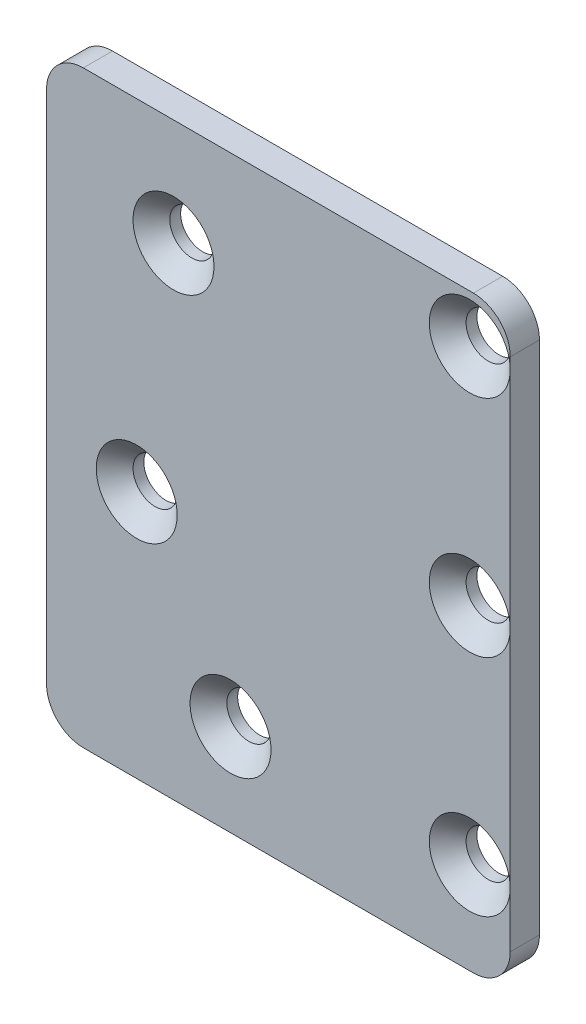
ISO-10303-21;
HEADER;
FILE_DESCRIPTION(('STEP AP214'),'2;1');
FILE_NAME('part.step','',(''),(''),'','','');
FILE_SCHEMA(('AUTOMOTIVE_DESIGN { 1 0 10303 214 1 1 1 1 }'));
ENDSEC;
DATA;
#1=APPLICATION_CONTEXT('core data for automotive mechanical design processes');
#2=APPLICATION_PROTOCOL_DEFINITION('international standard','automotive_design',2000,#1);
#3=PRODUCT_CONTEXT('',#1,'mechanical');
#4=PRODUCT('Part','Part','',(#3));
#5=PRODUCT_RELATED_PRODUCT_CATEGORY('part','',(#4));
#6=PRODUCT_DEFINITION_FORMATION('','',#4);
#7=PRODUCT_DEFINITION_CONTEXT('part definition',#1,'design');
#8=PRODUCT_DEFINITION('design','',#6,#7);
#9=PRODUCT_DEFINITION_SHAPE('','',#8);
#10=(LENGTH_UNIT() NAMED_UNIT(*) SI_UNIT(.MILLI.,.METRE.));
#11=(NAMED_UNIT(*) PLANE_ANGLE_UNIT() SI_UNIT($,.RADIAN.));
#12=(NAMED_UNIT(*) SI_UNIT($,.STERADIAN.) SOLID_ANGLE_UNIT());
#13=UNCERTAINTY_MEASURE_WITH_UNIT(LENGTH_MEASURE(1.E-05),#10,'distance_accuracy_value','');
#14=(GEOMETRIC_REPRESENTATION_CONTEXT(3) GLOBAL_UNCERTAINTY_ASSIGNED_CONTEXT((#13)) GLOBAL_UNIT_ASSIGNED_CONTEXT((#10,
#11,#12)) REPRESENTATION_CONTEXT('',''));
#15=CARTESIAN_POINT('',(0.,0.,0.));
#16=DIRECTION('',(0.,0.,1.));
#17=DIRECTION('',(1.,0.,0.));
#18=AXIS2_PLACEMENT_3D('',#15,#16,#17);
#19=CARTESIAN_POINT('',(0.,32.,0.));
#20=DIRECTION('',(0.,0.,-1.));
#21=DIRECTION('',(-1.,0.,0.));
#22=AXIS2_PLACEMENT_3D('',#19,#20,#21);
#23=PLANE('',#22);
#24=DIRECTION('',(-0.671519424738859,0.740986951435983,0.));
#25=VECTOR('',#24,1.);
#26=CARTESIAN_POINT('',(17.4070936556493,15.7751786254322,0.));
#27=LINE('',#26,#25);
#28=CARTESIAN_POINT('',(17.779506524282,15.3642402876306,0.));
#29=VERTEX_POINT('',#28);
#30=CARTESIAN_POINT('',(10.529506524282,23.3642402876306,0.));
#31=VERTEX_POINT('',#30);
#32=EDGE_CURVE('E459',#29,#31,#27,.T.);
#33=ORIENTED_EDGE('',*,*,#32,.F.);
#34=CARTESIAN_POINT('',(18.15,15.7,0.));
#35=DIRECTION('',(0.,0.,-1.));
#36=DIRECTION('',(-1.,0.,0.));
#37=AXIS2_PLACEMENT_3D('',#34,#35,#36);
#38=CIRCLE('',#37,0.499999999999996);
#39=CARTESIAN_POINT('',(18.520493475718,16.0357597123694,0.));
#40=VERTEX_POINT('',#39);
#41=EDGE_CURVE('E470',#40,#29,#38,.T.);
#42=ORIENTED_EDGE('',*,*,#41,.F.);
#43=DIRECTION('',(-0.671519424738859,0.740986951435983,0.));
#44=VECTOR('',#43,1.);
#45=CARTESIAN_POINT('',(18.1480806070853,16.446698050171,0.));
#46=LINE('',#45,#44);
#47=CARTESIAN_POINT('',(11.270493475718,24.0357597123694,0.));
#48=VERTEX_POINT('',#47);
#49=EDGE_CURVE('E483',#40,#48,#46,.T.);
#50=ORIENTED_EDGE('',*,*,#49,.T.);
#51=CARTESIAN_POINT('',(10.9,23.7,0.));
#52=DIRECTION('',(0.,0.,-1.));
#53=DIRECTION('',(-1.,0.,0.));
#54=AXIS2_PLACEMENT_3D('',#51,#52,#53);
#55=CIRCLE('',#54,0.499999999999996);
#56=EDGE_CURVE('E480',#31,#48,#55,.T.);
#57=ORIENTED_EDGE('',*,*,#56,.F.);
#58=EDGE_LOOP('',(#33,#42,#50,#57));
#59=FACE_BOUND('',#58,.T.);
#60=DIRECTION('',(-0.671519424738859,0.740986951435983,0.));
#61=VECTOR('',#60,1.);
#62=CARTESIAN_POINT('',(17.1847975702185,15.5737227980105,0.));
#63=LINE('',#62,#61);
#64=CARTESIAN_POINT('',(17.5572104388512,15.1627844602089,0.));
#65=VERTEX_POINT('',#64);
#66=CARTESIAN_POINT('',(10.3072104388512,23.1627844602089,0.));
#67=VERTEX_POINT('',#66);
#68=EDGE_CURVE('E398',#65,#67,#63,.T.);
#69=ORIENTED_EDGE('',*,*,#68,.T.);
#70=CARTESIAN_POINT('',(10.9,23.7,0.));
#71=DIRECTION('',(0.,0.,-1.));
#72=DIRECTION('',(-1.,0.,0.));
#73=AXIS2_PLACEMENT_3D('',#70,#71,#72);
#74=CIRCLE('',#73,0.799999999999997);
#75=CARTESIAN_POINT('',(11.4927895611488,24.2372155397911,0.));
#76=VERTEX_POINT('',#75);
#77=EDGE_CURVE('E361',#67,#76,#74,.T.);
#78=ORIENTED_EDGE('',*,*,#77,.T.);
#79=DIRECTION('',(-0.67151942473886,0.740986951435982,0.));
#80=VECTOR('',#79,1.);
#81=CARTESIAN_POINT('',(18.3703766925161,16.6481538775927,0.));
#82=LINE('',#81,#80);
#83=CARTESIAN_POINT('',(18.7427895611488,16.2372155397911,0.));
#84=VERTEX_POINT('',#83);
#85=EDGE_CURVE('E404',#84,#76,#82,.T.);
#86=ORIENTED_EDGE('',*,*,#85,.F.);
#87=CARTESIAN_POINT('',(18.15,15.7,0.));
#88=DIRECTION('',(0.,0.,-1.));
#89=DIRECTION('',(-1.,0.,0.));
#90=AXIS2_PLACEMENT_3D('',#87,#88,#89);
#91=CIRCLE('',#90,0.800000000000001);
#92=EDGE_CURVE('E401',#84,#65,#91,.T.);
#93=ORIENTED_EDGE('',*,*,#92,.T.);
#94=EDGE_LOOP('',(#69,#78,#86,#93));
#95=FACE_BOUND('',#94,.T.);
#96=ADVANCED_FACE('F81',(#59,#95),#23,.T.);
#97=CARTESIAN_POINT('',(17.4070936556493,15.7751786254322,0.5));
#98=DIRECTION('',(-0.740986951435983,-0.671519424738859,0.));
#99=DIRECTION('',(0.671519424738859,-0.740986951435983,0.));
#100=AXIS2_PLACEMENT_3D('',#97,#98,#99);
#101=PLANE('',#100);
#102=ORIENTED_EDGE('',*,*,#32,.T.);
#103=DIRECTION('',(0.,0.,-1.));
#104=VECTOR('',#103,1.);
#105=CARTESIAN_POINT('',(10.529506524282,23.3642402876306,0.5));
#106=LINE('',#105,#104);
#107=CARTESIAN_POINT('',(10.529506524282,23.3642402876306,0.5));
#108=VERTEX_POINT('',#107);
#109=EDGE_CURVE('E478',#108,#31,#106,.T.);
#110=ORIENTED_EDGE('',*,*,#109,.F.);
#111=DIRECTION('',(-0.671519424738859,0.740986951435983,0.));
#112=VECTOR('',#111,1.);
#113=CARTESIAN_POINT('',(17.4070936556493,15.7751786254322,0.5));
#114=LINE('',#113,#112);
#115=CARTESIAN_POINT('',(17.779506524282,15.3642402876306,0.5));
#116=VERTEX_POINT('',#115);
#117=EDGE_CURVE('E466',#116,#108,#114,.T.);
#118=ORIENTED_EDGE('',*,*,#117,.F.);
#119=DIRECTION('',(0.,0.,-1.));
#120=VECTOR('',#119,1.);
#121=CARTESIAN_POINT('',(17.779506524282,15.3642402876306,0.5));
#122=LINE('',#121,#120);
#123=EDGE_CURVE('E488',#116,#29,#122,.T.);
#124=ORIENTED_EDGE('',*,*,#123,.T.);
#125=EDGE_LOOP('',(#102,#110,#118,#124));
#126=FACE_BOUND('',#125,.T.);
#127=ADVANCED_FACE('F661',(#126),#101,.F.);
#128=CARTESIAN_POINT('',(18.15,15.7,0.5));
#129=DIRECTION('',(0.,0.,-1.));
#130=DIRECTION('',(-1.,0.,0.));
#131=AXIS2_PLACEMENT_3D('',#128,#129,#130);
#132=CYLINDRICAL_SURFACE('',#131,0.499999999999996);
#133=ORIENTED_EDGE('',*,*,#41,.T.);
#134=ORIENTED_EDGE('',*,*,#123,.F.);
#135=CARTESIAN_POINT('',(18.15,15.7,0.5));
#136=DIRECTION('',(0.,0.,-1.));
#137=DIRECTION('',(-1.,0.,0.));
#138=AXIS2_PLACEMENT_3D('',#135,#136,#137);
#139=CIRCLE('',#138,0.499999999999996);
#140=CARTESIAN_POINT('',(18.520493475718,16.0357597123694,0.5));
#141=VERTEX_POINT('',#140);
#142=EDGE_CURVE('E475',#141,#116,#139,.T.);
#143=ORIENTED_EDGE('',*,*,#142,.F.);
#144=DIRECTION('',(0.,0.,-1.));
#145=VECTOR('',#144,1.);
#146=CARTESIAN_POINT('',(18.520493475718,16.0357597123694,0.5));
#147=LINE('',#146,#145);
#148=EDGE_CURVE('E491',#141,#40,#147,.T.);
#149=ORIENTED_EDGE('',*,*,#148,.T.);
#150=EDGE_LOOP('',(#133,#134,#143,#149));
#151=FACE_BOUND('',#150,.T.);
#152=ADVANCED_FACE('F668',(#151),#132,.F.);
#153=CARTESIAN_POINT('',(18.1480806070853,16.446698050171,0.5));
#154=DIRECTION('',(-0.740986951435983,-0.671519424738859,0.));
#155=DIRECTION('',(0.671519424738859,-0.740986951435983,0.));
#156=AXIS2_PLACEMENT_3D('',#153,#154,#155);
#157=PLANE('',#156);
#158=ORIENTED_EDGE('',*,*,#49,.F.);
#159=ORIENTED_EDGE('',*,*,#148,.F.);
#160=DIRECTION('',(-0.671519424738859,0.740986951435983,0.));
#161=VECTOR('',#160,1.);
#162=CARTESIAN_POINT('',(18.1480806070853,16.446698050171,0.5));
#163=LINE('',#162,#161);
#164=CARTESIAN_POINT('',(11.270493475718,24.0357597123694,0.5));
#165=VERTEX_POINT('',#164);
#166=EDGE_CURVE('E473',#141,#165,#163,.T.);
#167=ORIENTED_EDGE('',*,*,#166,.T.);
#168=DIRECTION('',(0.,0.,-1.));
#169=VECTOR('',#168,1.);
#170=CARTESIAN_POINT('',(11.270493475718,24.0357597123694,0.5));
#171=LINE('',#170,#169);
#172=EDGE_CURVE('E493',#165,#48,#171,.T.);
#173=ORIENTED_EDGE('',*,*,#172,.T.);
#174=EDGE_LOOP('',(#158,#159,#167,#173));
#175=FACE_BOUND('',#174,.T.);
#176=ADVANCED_FACE('F771',(#175),#157,.T.);
#177=CARTESIAN_POINT('',(10.9,23.7,0.5));
#178=DIRECTION('',(0.,0.,-1.));
#179=DIRECTION('',(-1.,0.,0.));
#180=AXIS2_PLACEMENT_3D('',#177,#178,#179);
#181=CYLINDRICAL_SURFACE('',#180,0.499999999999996);
#182=ORIENTED_EDGE('',*,*,#56,.T.);
#183=ORIENTED_EDGE('',*,*,#172,.F.);
#184=CARTESIAN_POINT('',(10.9,23.7,0.5));
#185=DIRECTION('',(0.,0.,-1.));
#186=DIRECTION('',(-1.,0.,0.));
#187=AXIS2_PLACEMENT_3D('',#184,#185,#186);
#188=CIRCLE('',#187,0.499999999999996);
#189=EDGE_CURVE('E469',#108,#165,#188,.T.);
#190=ORIENTED_EDGE('',*,*,#189,.F.);
#191=ORIENTED_EDGE('',*,*,#109,.T.);
#192=EDGE_LOOP('',(#182,#183,#190,#191));
#193=FACE_BOUND('',#192,.T.);
#194=ADVANCED_FACE('F767',(#193),#181,.F.);
#195=CARTESIAN_POINT('',(0.,0.,0.5));
#196=DIRECTION('',(0.,0.,-1.));
#197=DIRECTION('',(-1.,0.,0.));
#198=AXIS2_PLACEMENT_3D('',#195,#196,#197);
#199=PLANE('',#198);
#200=ORIENTED_EDGE('',*,*,#117,.T.);
#201=ORIENTED_EDGE('',*,*,#189,.T.);
#202=ORIENTED_EDGE('',*,*,#166,.F.);
#203=ORIENTED_EDGE('',*,*,#142,.T.);
#204=EDGE_LOOP('',(#200,#201,#202,#203));
#205=FACE_BOUND('',#204,.T.);
#206=ADVANCED_FACE('F734',(#205),#199,.T.);
#207=CARTESIAN_POINT('',(16.1474158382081,14.6335956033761,0.75));
#208=DIRECTION('',(-0.740986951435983,-0.671519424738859,0.));
#209=DIRECTION('',(0.671519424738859,-0.740986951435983,0.));
#210=AXIS2_PLACEMENT_3D('',#207,#208,#209);
#211=PLANE('',#210);
#212=DIRECTION('',(-0.671519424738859,0.740986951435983,0.));
#213=VECTOR('',#212,1.);
#214=CARTESIAN_POINT('',(16.1474158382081,14.6335956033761,0.));
#215=LINE('',#214,#213);
#216=CARTESIAN_POINT('',(16.5198287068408,14.2226572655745,0.));
#217=VERTEX_POINT('',#216);
#218=CARTESIAN_POINT('',(9.26982870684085,22.2226572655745,0.));
#219=VERTEX_POINT('',#218);
#220=EDGE_CURVE('E407',#217,#219,#215,.T.);
#221=ORIENTED_EDGE('',*,*,#220,.T.);
#222=DIRECTION('',(0.,0.,-1.));
#223=VECTOR('',#222,1.);
#224=CARTESIAN_POINT('',(9.26982870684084,22.2226572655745,0.75));
#225=LINE('',#224,#223);
#226=CARTESIAN_POINT('',(9.26982870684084,22.2226572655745,0.75));
#227=VERTEX_POINT('',#226);
#228=EDGE_CURVE('E424',#227,#219,#225,.T.);
#229=ORIENTED_EDGE('',*,*,#228,.F.);
#230=DIRECTION('',(-0.671519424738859,0.740986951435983,0.));
#231=VECTOR('',#230,1.);
#232=CARTESIAN_POINT('',(16.1474158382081,14.6335956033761,0.75));
#233=LINE('',#232,#231);
#234=CARTESIAN_POINT('',(16.5198287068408,14.2226572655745,0.75));
#235=VERTEX_POINT('',#234);
#236=EDGE_CURVE('E384',#235,#227,#233,.T.);
#237=ORIENTED_EDGE('',*,*,#236,.F.);
#238=DIRECTION('',(0.,0.,-1.));
#239=VECTOR('',#238,1.);
#240=CARTESIAN_POINT('',(16.5198287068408,14.2226572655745,0.75));
#241=LINE('',#240,#239);
#242=EDGE_CURVE('E417',#235,#217,#241,.T.);
#243=ORIENTED_EDGE('',*,*,#242,.T.);
#244=EDGE_LOOP('',(#221,#229,#237,#243));
#245=FACE_BOUND('',#244,.T.);
#246=ADVANCED_FACE('F722',(#245),#211,.F.);
#247=CARTESIAN_POINT('',(18.15,15.7,0.75));
#248=DIRECTION('',(0.,0.,-1.));
#249=DIRECTION('',(-1.,0.,0.));
#250=AXIS2_PLACEMENT_3D('',#247,#248,#249);
#251=CYLINDRICAL_SURFACE('',#250,2.19999999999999);
#252=CARTESIAN_POINT('',(18.15,15.7,0.));
#253=DIRECTION('',(0.,0.,-1.));
#254=DIRECTION('',(-1.,0.,0.));
#255=AXIS2_PLACEMENT_3D('',#252,#253,#254);
#256=CIRCLE('',#255,2.19999999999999);
#257=CARTESIAN_POINT('',(19.7801712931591,17.1773427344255,0.));
#258=VERTEX_POINT('',#257);
#259=EDGE_CURVE('E377',#258,#217,#256,.T.);
#260=ORIENTED_EDGE('',*,*,#259,.T.);
#261=ORIENTED_EDGE('',*,*,#242,.F.);
#262=CARTESIAN_POINT('',(18.15,15.7,0.75));
#263=DIRECTION('',(0.,0.,-1.));
#264=DIRECTION('',(-1.,0.,0.));
#265=AXIS2_PLACEMENT_3D('',#262,#263,#264);
#266=CIRCLE('',#265,2.19999999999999);
#267=CARTESIAN_POINT('',(19.7801712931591,17.1773427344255,0.75));
#268=VERTEX_POINT('',#267);
#269=EDGE_CURVE('E392',#268,#235,#266,.T.);
#270=ORIENTED_EDGE('',*,*,#269,.F.);
#271=DIRECTION('',(0.,0.,-1.));
#272=VECTOR('',#271,1.);
#273=CARTESIAN_POINT('',(19.7801712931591,17.1773427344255,0.75));
#274=LINE('',#273,#272);
#275=EDGE_CURVE('E420',#268,#258,#274,.T.);
#276=ORIENTED_EDGE('',*,*,#275,.T.);
#277=EDGE_LOOP('',(#260,#261,#270,#276));
#278=FACE_BOUND('',#277,.T.);
#279=ADVANCED_FACE('F718',(#278),#251,.F.);
#280=CARTESIAN_POINT('',(19.4077584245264,17.5882810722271,0.75));
#281=DIRECTION('',(-0.740986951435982,-0.671519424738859,0.));
#282=DIRECTION('',(0.67151942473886,-0.740986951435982,0.));
#283=AXIS2_PLACEMENT_3D('',#280,#281,#282);
#284=PLANE('',#283);
#285=DIRECTION('',(-0.67151942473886,0.740986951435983,0.));
#286=VECTOR('',#285,1.);
#287=CARTESIAN_POINT('',(19.4077584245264,17.5882810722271,0.));
#288=LINE('',#287,#286);
#289=CARTESIAN_POINT('',(12.5301712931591,25.1773427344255,0.));
#290=VERTEX_POINT('',#289);
#291=EDGE_CURVE('E412',#258,#290,#288,.T.);
#292=ORIENTED_EDGE('',*,*,#291,.F.);
#293=ORIENTED_EDGE('',*,*,#275,.F.);
#294=DIRECTION('',(-0.67151942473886,0.740986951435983,0.));
#295=VECTOR('',#294,1.);
#296=CARTESIAN_POINT('',(19.4077584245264,17.5882810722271,0.75));
#297=LINE('',#296,#295);
#298=CARTESIAN_POINT('',(12.5301712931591,25.1773427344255,0.75));
#299=VERTEX_POINT('',#298);
#300=EDGE_CURVE('E390',#268,#299,#297,.T.);
#301=ORIENTED_EDGE('',*,*,#300,.T.);
#302=DIRECTION('',(0.,0.,-1.));
#303=VECTOR('',#302,1.);
#304=CARTESIAN_POINT('',(12.5301712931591,25.1773427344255,0.75));
#305=LINE('',#304,#303);
#306=EDGE_CURVE('E422',#299,#290,#305,.T.);
#307=ORIENTED_EDGE('',*,*,#306,.T.);
#308=EDGE_LOOP('',(#292,#293,#301,#307));
#309=FACE_BOUND('',#308,.T.);
#310=ADVANCED_FACE('F721',(#309),#284,.T.);
#311=CARTESIAN_POINT('',(10.9,23.7,0.75));
#312=DIRECTION('',(0.,0.,-1.));
#313=DIRECTION('',(-1.,0.,0.));
#314=AXIS2_PLACEMENT_3D('',#311,#312,#313);
#315=CYLINDRICAL_SURFACE('',#314,0.799999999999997);
#316=ORIENTED_EDGE('',*,*,#77,.F.);
#317=DIRECTION('',(0.,0.,-1.));
#318=VECTOR('',#317,1.);
#319=CARTESIAN_POINT('',(10.3072104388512,23.1627844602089,0.75));
#320=LINE('',#319,#318);
#321=CARTESIAN_POINT('',(10.3072104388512,23.1627844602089,0.75));
#322=VERTEX_POINT('',#321);
#323=EDGE_CURVE('E395',#322,#67,#320,.T.);
#324=ORIENTED_EDGE('',*,*,#323,.F.);
#325=CARTESIAN_POINT('',(10.9,23.7,0.75));
#326=DIRECTION('',(0.,0.,-1.));
#327=DIRECTION('',(-1.,0.,0.));
#328=AXIS2_PLACEMENT_3D('',#325,#326,#327);
#329=CIRCLE('',#328,0.799999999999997);
#330=CARTESIAN_POINT('',(11.4927895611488,24.2372155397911,0.75));
#331=VERTEX_POINT('',#330);
#332=EDGE_CURVE('E374',#322,#331,#329,.T.);
#333=ORIENTED_EDGE('',*,*,#332,.T.);
#334=DIRECTION('',(0.,0.,-1.));
#335=VECTOR('',#334,1.);
#336=CARTESIAN_POINT('',(11.4927895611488,24.2372155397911,0.75));
#337=LINE('',#336,#335);
#338=EDGE_CURVE('E427',#331,#76,#337,.T.);
#339=ORIENTED_EDGE('',*,*,#338,.T.);
#340=EDGE_LOOP('',(#316,#324,#333,#339));
#341=FACE_BOUND('',#340,.T.);
#342=ADVANCED_FACE('F726',(#341),#315,.T.);
#343=CARTESIAN_POINT('',(18.3703766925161,16.6481538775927,0.75));
#344=DIRECTION('',(-0.740986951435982,-0.671519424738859,0.));
#345=DIRECTION('',(0.67151942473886,-0.740986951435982,0.));
#346=AXIS2_PLACEMENT_3D('',#343,#344,#345);
#347=PLANE('',#346);
#348=ORIENTED_EDGE('',*,*,#85,.T.);
#349=ORIENTED_EDGE('',*,*,#338,.F.);
#350=DIRECTION('',(-0.67151942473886,0.740986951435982,0.));
#351=VECTOR('',#350,1.);
#352=CARTESIAN_POINT('',(18.3703766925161,16.6481538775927,0.75));
#353=LINE('',#352,#351);
#354=CARTESIAN_POINT('',(18.7427895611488,16.2372155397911,0.75));
#355=VERTEX_POINT('',#354);
#356=EDGE_CURVE('E381',#355,#331,#353,.T.);
#357=ORIENTED_EDGE('',*,*,#356,.F.);
#358=DIRECTION('',(0.,0.,-1.));
#359=VECTOR('',#358,1.);
#360=CARTESIAN_POINT('',(18.7427895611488,16.2372155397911,0.75));
#361=LINE('',#360,#359);
#362=EDGE_CURVE('E429',#355,#84,#361,.T.);
#363=ORIENTED_EDGE('',*,*,#362,.T.);
#364=EDGE_LOOP('',(#348,#349,#357,#363));
#365=FACE_BOUND('',#364,.T.);
#366=ADVANCED_FACE('F736',(#365),#347,.F.);
#367=CARTESIAN_POINT('',(18.15,15.7,0.75));
#368=DIRECTION('',(0.,0.,-1.));
#369=DIRECTION('',(-1.,0.,0.));
#370=AXIS2_PLACEMENT_3D('',#367,#368,#369);
#371=CYLINDRICAL_SURFACE('',#370,0.800000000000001);
#372=ORIENTED_EDGE('',*,*,#92,.F.);
#373=ORIENTED_EDGE('',*,*,#362,.F.);
#374=CARTESIAN_POINT('',(18.15,15.7,0.75));
#375=DIRECTION('',(0.,0.,-1.));
#376=DIRECTION('',(-1.,0.,0.));
#377=AXIS2_PLACEMENT_3D('',#374,#375,#376);
#378=CIRCLE('',#377,0.800000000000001);
#379=CARTESIAN_POINT('',(17.5572104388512,15.1627844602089,0.75));
#380=VERTEX_POINT('',#379);
#381=EDGE_CURVE('E379',#355,#380,#378,.T.);
#382=ORIENTED_EDGE('',*,*,#381,.T.);
#383=DIRECTION('',(0.,0.,-1.));
#384=VECTOR('',#383,1.);
#385=CARTESIAN_POINT('',(17.5572104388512,15.1627844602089,0.75));
#386=LINE('',#385,#384);
#387=EDGE_CURVE('E431',#380,#65,#386,.T.);
#388=ORIENTED_EDGE('',*,*,#387,.T.);
#389=EDGE_LOOP('',(#372,#373,#382,#388));
#390=FACE_BOUND('',#389,.T.);
#391=ADVANCED_FACE('F739',(#390),#371,.T.);
#392=CARTESIAN_POINT('',(17.1847975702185,15.5737227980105,0.75));
#393=DIRECTION('',(-0.740986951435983,-0.671519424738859,0.));
#394=DIRECTION('',(0.671519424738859,-0.740986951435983,0.));
#395=AXIS2_PLACEMENT_3D('',#392,#393,#394);
#396=PLANE('',#395);
#397=ORIENTED_EDGE('',*,*,#68,.F.);
#398=ORIENTED_EDGE('',*,*,#387,.F.);
#399=DIRECTION('',(-0.671519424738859,0.740986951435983,0.));
#400=VECTOR('',#399,1.);
#401=CARTESIAN_POINT('',(17.1847975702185,15.5737227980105,0.75));
#402=LINE('',#401,#400);
#403=EDGE_CURVE('E376',#380,#322,#402,.T.);
#404=ORIENTED_EDGE('',*,*,#403,.T.);
#405=ORIENTED_EDGE('',*,*,#323,.T.);
#406=EDGE_LOOP('',(#397,#398,#404,#405));
#407=FACE_BOUND('',#406,.T.);
#408=ADVANCED_FACE('F730',(#407),#396,.T.);
#409=CARTESIAN_POINT('',(10.9,23.7,0.75));
#410=DIRECTION('',(0.,0.,-1.));
#411=DIRECTION('',(-1.,0.,0.));
#412=AXIS2_PLACEMENT_3D('',#409,#410,#411);
#413=CYLINDRICAL_SURFACE('',#412,2.19999999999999);
#414=CARTESIAN_POINT('',(10.9,23.7,0.));
#415=DIRECTION('',(0.,0.,-1.));
#416=DIRECTION('',(-1.,0.,0.));
#417=AXIS2_PLACEMENT_3D('',#414,#415,#416);
#418=CIRCLE('',#417,2.19999999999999);
#419=EDGE_CURVE('E409',#219,#290,#418,.T.);
#420=ORIENTED_EDGE('',*,*,#419,.T.);
#421=ORIENTED_EDGE('',*,*,#306,.F.);
#422=CARTESIAN_POINT('',(10.9,23.7,0.75));
#423=DIRECTION('',(0.,0.,-1.));
#424=DIRECTION('',(-1.,0.,0.));
#425=AXIS2_PLACEMENT_3D('',#422,#423,#424);
#426=CIRCLE('',#425,2.19999999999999);
#427=EDGE_CURVE('E387',#227,#299,#426,.T.);
#428=ORIENTED_EDGE('',*,*,#427,.F.);
#429=ORIENTED_EDGE('',*,*,#228,.T.);
#430=EDGE_LOOP('',(#420,#421,#428,#429));
#431=FACE_BOUND('',#430,.T.);
#432=ADVANCED_FACE('F716',(#431),#413,.F.);
#433=CARTESIAN_POINT('',(0.,0.,0.75));
#434=DIRECTION('',(0.,0.,-1.));
#435=DIRECTION('',(-1.,0.,0.));
#436=AXIS2_PLACEMENT_3D('',#433,#434,#435);
#437=PLANE('',#436);
#438=ORIENTED_EDGE('',*,*,#332,.F.);
#439=ORIENTED_EDGE('',*,*,#403,.F.);
#440=ORIENTED_EDGE('',*,*,#381,.F.);
#441=ORIENTED_EDGE('',*,*,#356,.T.);
#442=EDGE_LOOP('',(#438,#439,#440,#441));
#443=FACE_BOUND('',#442,.T.);
#444=ORIENTED_EDGE('',*,*,#236,.T.);
#445=ORIENTED_EDGE('',*,*,#427,.T.);
#446=ORIENTED_EDGE('',*,*,#300,.F.);
#447=ORIENTED_EDGE('',*,*,#269,.T.);
#448=EDGE_LOOP('',(#444,#445,#446,#447));
#449=FACE_BOUND('',#448,.T.);
#450=ADVANCED_FACE('F654',(#443,#449),#437,.T.);
#451=CARTESIAN_POINT('',(10.,5.,1.5875));
#452=DIRECTION('',(0.,0.,1.));
#453=DIRECTION('',(1.,0.,0.));
#454=AXIS2_PLACEMENT_3D('',#451,#452,#453);
#455=CONICAL_SURFACE('',#454,2.2,0.785398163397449);
#456=CARTESIAN_POINT('',(10.,5.,0.587499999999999));
#457=DIRECTION('',(0.,0.,1.));
#458=DIRECTION('',(1.,0.,0.));
#459=AXIS2_PLACEMENT_3D('',#456,#457,#458);
#460=CIRCLE('',#459,1.2);
#461=CARTESIAN_POINT('',(11.2,5.,0.587499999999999));
#462=VERTEX_POINT('',#461);
#463=EDGE_CURVE('E499',#462,#462,#460,.T.);
#464=ORIENTED_EDGE('',*,*,#463,.F.);
#465=EDGE_LOOP('',(#464));
#466=FACE_BOUND('',#465,.T.);
#467=CARTESIAN_POINT('',(10.,5.,1.5875));
#468=DIRECTION('',(0.,0.,1.));
#469=DIRECTION('',(1.,0.,0.));
#470=AXIS2_PLACEMENT_3D('',#467,#468,#469);
#471=CIRCLE('',#470,2.2);
#472=CARTESIAN_POINT('',(12.2,5.,1.5875));
#473=VERTEX_POINT('',#472);
#474=EDGE_CURVE('E490',#473,#473,#471,.T.);
#475=ORIENTED_EDGE('',*,*,#474,.T.);
#476=EDGE_LOOP('',(#475));
#477=FACE_BOUND('',#476,.T.);
#478=ADVANCED_FACE('F644',(#466,#477),#455,.F.);
#479=CARTESIAN_POINT('',(23.,5.,1.5875));
#480=DIRECTION('',(0.,0.,1.));
#481=DIRECTION('',(1.,0.,0.));
#482=AXIS2_PLACEMENT_3D('',#479,#480,#481);
#483=CONICAL_SURFACE('',#482,2.2,0.785398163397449);
#484=CARTESIAN_POINT('',(23.,5.,0.587499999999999));
#485=DIRECTION('',(0.,0.,1.));
#486=DIRECTION('',(1.,0.,0.));
#487=AXIS2_PLACEMENT_3D('',#484,#485,#486);
#488=CIRCLE('',#487,1.2);
#489=CARTESIAN_POINT('',(24.2,5.,0.587499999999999));
#490=VERTEX_POINT('',#489);
#491=EDGE_CURVE('E508',#490,#490,#488,.T.);
#492=ORIENTED_EDGE('',*,*,#491,.F.);
#493=EDGE_LOOP('',(#492));
#494=FACE_BOUND('',#493,.T.);
#495=CARTESIAN_POINT('',(23.,5.,1.5875));
#496=DIRECTION('',(0.,0.,1.));
#497=DIRECTION('',(1.,0.,0.));
#498=AXIS2_PLACEMENT_3D('',#495,#496,#497);
#499=CIRCLE('',#498,2.2);
#500=CARTESIAN_POINT('',(25.2,5.,1.5875));
#501=VERTEX_POINT('',#500);
#502=EDGE_CURVE('E505',#501,#501,#499,.T.);
#503=ORIENTED_EDGE('',*,*,#502,.T.);
#504=EDGE_LOOP('',(#503));
#505=FACE_BOUND('',#504,.T.);
#506=ADVANCED_FACE('F642',(#494,#505),#483,.F.);
#507=CARTESIAN_POINT('',(0.,32.,1.5875));
#508=DIRECTION('',(0.,0.,-1.));
#509=DIRECTION('',(-1.,0.,0.));
#510=AXIS2_PLACEMENT_3D('',#507,#508,#509);
#511=PLANE('',#510);
#512=ORIENTED_EDGE('',*,*,#474,.F.);
#513=EDGE_LOOP('',(#512));
#514=FACE_BOUND('',#513,.T.);
#515=CARTESIAN_POINT('',(6.9,26.2,1.5875));
#516=DIRECTION('',(0.,0.,1.));
#517=DIRECTION('',(1.,0.,0.));
#518=AXIS2_PLACEMENT_3D('',#515,#516,#517);
#519=CIRCLE('',#518,2.2);
#520=CARTESIAN_POINT('',(9.1,26.2,1.5875));
#521=VERTEX_POINT('',#520);
#522=EDGE_CURVE('E541',#521,#521,#519,.T.);
#523=ORIENTED_EDGE('',*,*,#522,.F.);
#524=EDGE_LOOP('',(#523));
#525=FACE_BOUND('',#524,.T.);
#526=CARTESIAN_POINT('',(4.9,13.5,1.5875));
#527=DIRECTION('',(0.,0.,1.));
#528=DIRECTION('',(1.,0.,0.));
#529=AXIS2_PLACEMENT_3D('',#526,#527,#528);
#530=CIRCLE('',#529,2.2);
#531=CARTESIAN_POINT('',(7.1,13.5,1.5875));
#532=VERTEX_POINT('',#531);
#533=EDGE_CURVE('E532',#532,#532,#530,.T.);
#534=ORIENTED_EDGE('',*,*,#533,.F.);
#535=EDGE_LOOP('',(#534));
#536=FACE_BOUND('',#535,.T.);
#537=DIRECTION('',(0.,-1.,0.));
#538=VECTOR('',#537,1.);
#539=CARTESIAN_POINT('',(0.,0.,1.5875));
#540=LINE('',#539,#538);
#541=CARTESIAN_POINT('',(0.,30.,1.5875));
#542=VERTEX_POINT('',#541);
#543=CARTESIAN_POINT('',(0.,2.,1.5875));
#544=VERTEX_POINT('',#543);
#545=EDGE_CURVE('E551',#542,#544,#540,.T.);
#546=ORIENTED_EDGE('',*,*,#545,.T.);
#547=CARTESIAN_POINT('',(2.,2.,1.5875));
#548=DIRECTION('',(0.,0.,-1.));
#549=DIRECTION('',(-1.,0.,0.));
#550=AXIS2_PLACEMENT_3D('',#547,#548,#549);
#551=CIRCLE('',#550,2.);
#552=CARTESIAN_POINT('',(2.,0.,1.5875));
#553=VERTEX_POINT('',#552);
#554=EDGE_CURVE('E596',#544,#553,#551,.F.);
#555=ORIENTED_EDGE('',*,*,#554,.T.);
#556=DIRECTION('',(1.,0.,0.));
#557=VECTOR('',#556,1.);
#558=CARTESIAN_POINT('',(0.,0.,1.5875));
#559=LINE('',#558,#557);
#560=CARTESIAN_POINT('',(23.2,0.,1.5875));
#561=VERTEX_POINT('',#560);
#562=EDGE_CURVE('E554',#553,#561,#559,.T.);
#563=ORIENTED_EDGE('',*,*,#562,.T.);
#564=CARTESIAN_POINT('',(23.2,2.,1.5875));
#565=DIRECTION('',(0.,0.,-1.));
#566=DIRECTION('',(-1.,0.,0.));
#567=AXIS2_PLACEMENT_3D('',#564,#565,#566);
#568=CIRCLE('',#567,2.);
#569=CARTESIAN_POINT('',(25.2,2.,1.5875));
#570=VERTEX_POINT('',#569);
#571=EDGE_CURVE('E594',#561,#570,#568,.F.);
#572=ORIENTED_EDGE('',*,*,#571,.T.);
#573=DIRECTION('',(0.,1.,0.));
#574=VECTOR('',#573,1.);
#575=CARTESIAN_POINT('',(25.2,0.,1.5875));
#576=LINE('',#575,#574);
#577=EDGE_CURVE('E559',#570,#501,#576,.T.);
#578=ORIENTED_EDGE('',*,*,#577,.T.);
#579=ORIENTED_EDGE('',*,*,#502,.F.);
#580=CARTESIAN_POINT('',(25.2,17.2,1.5875));
#581=VERTEX_POINT('',#580);
#582=EDGE_CURVE('E562',#501,#581,#576,.T.);
#583=ORIENTED_EDGE('',*,*,#582,.T.);
#584=CARTESIAN_POINT('',(23.,17.2,1.5875));
#585=DIRECTION('',(0.,0.,1.));
#586=DIRECTION('',(1.,0.,0.));
#587=AXIS2_PLACEMENT_3D('',#584,#585,#586);
#588=CIRCLE('',#587,2.2);
#589=EDGE_CURVE('E514',#581,#581,#588,.T.);
#590=ORIENTED_EDGE('',*,*,#589,.F.);
#591=CARTESIAN_POINT('',(25.2,29.4,1.5875));
#592=VERTEX_POINT('',#591);
#593=EDGE_CURVE('E848',#581,#592,#576,.T.);
#594=ORIENTED_EDGE('',*,*,#593,.T.);
#595=CARTESIAN_POINT('',(23.,29.4,1.5875));
#596=DIRECTION('',(0.,0.,1.));
#597=DIRECTION('',(1.,0.,0.));
#598=AXIS2_PLACEMENT_3D('',#595,#596,#597);
#599=CIRCLE('',#598,2.2);
#600=EDGE_CURVE('E523',#592,#592,#599,.T.);
#601=ORIENTED_EDGE('',*,*,#600,.F.);
#602=CARTESIAN_POINT('',(25.2,30.,1.5875));
#603=VERTEX_POINT('',#602);
#604=EDGE_CURVE('E558',#592,#603,#576,.T.);
#605=ORIENTED_EDGE('',*,*,#604,.T.);
#606=CARTESIAN_POINT('',(23.2,30.,1.5875));
#607=DIRECTION('',(0.,0.,-1.));
#608=DIRECTION('',(-1.,0.,0.));
#609=AXIS2_PLACEMENT_3D('',#606,#607,#608);
#610=CIRCLE('',#609,2.);
#611=CARTESIAN_POINT('',(23.2,32.,1.5875));
#612=VERTEX_POINT('',#611);
#613=EDGE_CURVE('E101',#603,#612,#610,.F.);
#614=ORIENTED_EDGE('',*,*,#613,.T.);
#615=DIRECTION('',(-1.,0.,0.));
#616=VECTOR('',#615,1.);
#617=CARTESIAN_POINT('',(0.,32.,1.5875));
#618=LINE('',#617,#616);
#619=CARTESIAN_POINT('',(2.,32.,1.5875));
#620=VERTEX_POINT('',#619);
#621=EDGE_CURVE('E561',#612,#620,#618,.T.);
#622=ORIENTED_EDGE('',*,*,#621,.T.);
#623=CARTESIAN_POINT('',(2.,30.,1.5875));
#624=DIRECTION('',(0.,0.,-1.));
#625=DIRECTION('',(-1.,0.,0.));
#626=AXIS2_PLACEMENT_3D('',#623,#624,#625);
#627=CIRCLE('',#626,2.);
#628=EDGE_CURVE('E592',#620,#542,#627,.F.);
#629=ORIENTED_EDGE('',*,*,#628,.T.);
#630=EDGE_LOOP('',(#546,#555,#563,#572,#578,#579,#583,#590,#594,#601,#605,#614,#622,#629));
#631=FACE_BOUND('',#630,.T.);
#632=ADVANCED_FACE('F622',(#514,#525,#536,#631),#511,.F.);
#633=CARTESIAN_POINT('',(6.9,26.2,1.5875));
#634=DIRECTION('',(0.,0.,1.));
#635=DIRECTION('',(1.,0.,0.));
#636=AXIS2_PLACEMENT_3D('',#633,#634,#635);
#637=CONICAL_SURFACE('',#636,2.2,0.785398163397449);
#638=CARTESIAN_POINT('',(6.9,26.2,0.587499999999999));
#639=DIRECTION('',(0.,0.,1.));
#640=DIRECTION('',(1.,0.,0.));
#641=AXIS2_PLACEMENT_3D('',#638,#639,#640);
#642=CIRCLE('',#641,1.2);
#643=CARTESIAN_POINT('',(8.1,26.2,0.587499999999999));
#644=VERTEX_POINT('',#643);
#645=EDGE_CURVE('E544',#644,#644,#642,.T.);
#646=ORIENTED_EDGE('',*,*,#645,.F.);
#647=EDGE_LOOP('',(#646));
#648=FACE_BOUND('',#647,.T.);
#649=ORIENTED_EDGE('',*,*,#522,.T.);
#650=EDGE_LOOP('',(#649));
#651=FACE_BOUND('',#650,.T.);
#652=ADVANCED_FACE('F651',(#648,#651),#637,.F.);
#653=CARTESIAN_POINT('',(4.9,13.5,1.5875));
#654=DIRECTION('',(0.,0.,1.));
#655=DIRECTION('',(1.,0.,0.));
#656=AXIS2_PLACEMENT_3D('',#653,#654,#655);
#657=CONICAL_SURFACE('',#656,2.2,0.785398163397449);
#658=CARTESIAN_POINT('',(4.9,13.5,0.587499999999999));
#659=DIRECTION('',(0.,0.,1.));
#660=DIRECTION('',(1.,0.,0.));
#661=AXIS2_PLACEMENT_3D('',#658,#659,#660);
#662=CIRCLE('',#661,1.2);
#663=CARTESIAN_POINT('',(6.1,13.5,0.587499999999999));
#664=VERTEX_POINT('',#663);
#665=EDGE_CURVE('E535',#664,#664,#662,.T.);
#666=ORIENTED_EDGE('',*,*,#665,.F.);
#667=EDGE_LOOP('',(#666));
#668=FACE_BOUND('',#667,.T.);
#669=ORIENTED_EDGE('',*,*,#533,.T.);
#670=EDGE_LOOP('',(#669));
#671=FACE_BOUND('',#670,.T.);
#672=ADVANCED_FACE('F801',(#668,#671),#657,.F.);
#673=CARTESIAN_POINT('',(23.,29.4,1.5875));
#674=DIRECTION('',(0.,0.,1.));
#675=DIRECTION('',(1.,0.,0.));
#676=AXIS2_PLACEMENT_3D('',#673,#674,#675);
#677=CONICAL_SURFACE('',#676,2.2,0.785398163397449);
#678=CARTESIAN_POINT('',(23.,29.4,0.587499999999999));
#679=DIRECTION('',(0.,0.,1.));
#680=DIRECTION('',(1.,0.,0.));
#681=AXIS2_PLACEMENT_3D('',#678,#679,#680);
#682=CIRCLE('',#681,1.2);
#683=CARTESIAN_POINT('',(24.2,29.4,0.587499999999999));
#684=VERTEX_POINT('',#683);
#685=EDGE_CURVE('E526',#684,#684,#682,.T.);
#686=ORIENTED_EDGE('',*,*,#685,.F.);
#687=EDGE_LOOP('',(#686));
#688=FACE_BOUND('',#687,.T.);
#689=ORIENTED_EDGE('',*,*,#600,.T.);
#690=EDGE_LOOP('',(#689));
#691=FACE_BOUND('',#690,.T.);
#692=ADVANCED_FACE('F788',(#688,#691),#677,.F.);
#693=CARTESIAN_POINT('',(23.,17.2,1.5875));
#694=DIRECTION('',(0.,0.,1.));
#695=DIRECTION('',(1.,0.,0.));
#696=AXIS2_PLACEMENT_3D('',#693,#694,#695);
#697=CONICAL_SURFACE('',#696,2.2,0.785398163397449);
#698=CARTESIAN_POINT('',(23.,17.2,0.587499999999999));
#699=DIRECTION('',(0.,0.,1.));
#700=DIRECTION('',(1.,0.,0.));
#701=AXIS2_PLACEMENT_3D('',#698,#699,#700);
#702=CIRCLE('',#701,1.2);
#703=CARTESIAN_POINT('',(24.2,17.2,0.587499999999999));
#704=VERTEX_POINT('',#703);
#705=EDGE_CURVE('E517',#704,#704,#702,.T.);
#706=ORIENTED_EDGE('',*,*,#705,.F.);
#707=EDGE_LOOP('',(#706));
#708=FACE_BOUND('',#707,.T.);
#709=ORIENTED_EDGE('',*,*,#589,.T.);
#710=EDGE_LOOP('',(#709));
#711=FACE_BOUND('',#710,.T.);
#712=ADVANCED_FACE('F781',(#708,#711),#697,.F.);
#713=CARTESIAN_POINT('',(10.,5.,1.5875));
#714=DIRECTION('',(0.,0.,1.));
#715=DIRECTION('',(1.,0.,0.));
#716=AXIS2_PLACEMENT_3D('',#713,#714,#715);
#717=CYLINDRICAL_SURFACE('',#716,1.2);
#718=CARTESIAN_POINT('',(10.,5.,0.));
#719=DIRECTION('',(0.,0.,1.));
#720=DIRECTION('',(1.,0.,0.));
#721=AXIS2_PLACEMENT_3D('',#718,#719,#720);
#722=CIRCLE('',#721,1.2);
#723=CARTESIAN_POINT('',(11.2,5.,0.));
#724=VERTEX_POINT('',#723);
#725=EDGE_CURVE('E502',#724,#724,#722,.T.);
#726=ORIENTED_EDGE('',*,*,#725,.F.);
#727=EDGE_LOOP('',(#726));
#728=FACE_BOUND('',#727,.T.);
#729=ORIENTED_EDGE('',*,*,#463,.T.);
#730=EDGE_LOOP('',(#729));
#731=FACE_BOUND('',#730,.T.);
#732=ADVANCED_FACE('F778',(#728,#731),#717,.F.);
#733=CARTESIAN_POINT('',(23.,5.,1.5875));
#734=DIRECTION('',(0.,0.,1.));
#735=DIRECTION('',(1.,0.,0.));
#736=AXIS2_PLACEMENT_3D('',#733,#734,#735);
#737=CYLINDRICAL_SURFACE('',#736,1.2);
#738=CARTESIAN_POINT('',(23.,5.,0.));
#739=DIRECTION('',(0.,0.,1.));
#740=DIRECTION('',(1.,0.,0.));
#741=AXIS2_PLACEMENT_3D('',#738,#739,#740);
#742=CIRCLE('',#741,1.2);
#743=CARTESIAN_POINT('',(24.2,5.,0.));
#744=VERTEX_POINT('',#743);
#745=EDGE_CURVE('E511',#744,#744,#742,.T.);
#746=ORIENTED_EDGE('',*,*,#745,.F.);
#747=EDGE_LOOP('',(#746));
#748=FACE_BOUND('',#747,.T.);
#749=ORIENTED_EDGE('',*,*,#491,.T.);
#750=EDGE_LOOP('',(#749));
#751=FACE_BOUND('',#750,.T.);
#752=ADVANCED_FACE('F780',(#748,#751),#737,.F.);
#753=CARTESIAN_POINT('',(0.,0.,1.5875));
#754=DIRECTION('',(0.,1.,0.));
#755=DIRECTION('',(0.,0.,1.));
#756=AXIS2_PLACEMENT_3D('',#753,#754,#755);
#757=PLANE('',#756);
#758=ORIENTED_EDGE('',*,*,#562,.F.);
#759=DIRECTION('',(0.,0.,-1.));
#760=VECTOR('',#759,1.);
#761=CARTESIAN_POINT('',(2.,0.,1.5875));
#762=LINE('',#761,#760);
#763=CARTESIAN_POINT('',(2.,0.,0.));
#764=VERTEX_POINT('',#763);
#765=EDGE_CURVE('E575',#553,#764,#762,.T.);
#766=ORIENTED_EDGE('',*,*,#765,.T.);
#767=DIRECTION('',(1.,0.,0.));
#768=VECTOR('',#767,1.);
#769=CARTESIAN_POINT('',(0.,0.,0.));
#770=LINE('',#769,#768);
#771=CARTESIAN_POINT('',(23.2,0.,0.));
#772=VERTEX_POINT('',#771);
#773=EDGE_CURVE('E567',#764,#772,#770,.T.);
#774=ORIENTED_EDGE('',*,*,#773,.T.);
#775=DIRECTION('',(0.,0.,-1.));
#776=VECTOR('',#775,1.);
#777=CARTESIAN_POINT('',(23.2,0.,1.5875));
#778=LINE('',#777,#776);
#779=EDGE_CURVE('E564',#772,#561,#778,.F.);
#780=ORIENTED_EDGE('',*,*,#779,.T.);
#781=EDGE_LOOP('',(#758,#766,#774,#780));
#782=FACE_BOUND('',#781,.T.);
#783=ADVANCED_FACE('F628',(#782),#757,.F.);
#784=CARTESIAN_POINT('',(25.2,0.,1.5875));
#785=DIRECTION('',(-1.,0.,0.));
#786=DIRECTION('',(0.,-1.,0.));
#787=AXIS2_PLACEMENT_3D('',#784,#785,#786);
#788=PLANE('',#787);
#789=ORIENTED_EDGE('',*,*,#577,.F.);
#790=DIRECTION('',(0.,0.,-1.));
#791=VECTOR('',#790,1.);
#792=CARTESIAN_POINT('',(25.2,2.,1.5875));
#793=LINE('',#792,#791);
#794=CARTESIAN_POINT('',(25.2,2.,0.));
#795=VERTEX_POINT('',#794);
#796=EDGE_CURVE('E600',#570,#795,#793,.T.);
#797=ORIENTED_EDGE('',*,*,#796,.T.);
#798=DIRECTION('',(0.,1.,0.));
#799=VECTOR('',#798,1.);
#800=CARTESIAN_POINT('',(25.2,0.,0.));
#801=LINE('',#800,#799);
#802=CARTESIAN_POINT('',(25.2,30.,0.));
#803=VERTEX_POINT('',#802);
#804=EDGE_CURVE('E570',#795,#803,#801,.T.);
#805=ORIENTED_EDGE('',*,*,#804,.T.);
#806=DIRECTION('',(0.,0.,-1.));
#807=VECTOR('',#806,1.);
#808=CARTESIAN_POINT('',(25.2,30.,1.5875));
#809=LINE('',#808,#807);
#810=EDGE_CURVE('E598',#803,#603,#809,.F.);
#811=ORIENTED_EDGE('',*,*,#810,.T.);
#812=ORIENTED_EDGE('',*,*,#604,.F.);
#813=ORIENTED_EDGE('',*,*,#593,.F.);
#814=ORIENTED_EDGE('',*,*,#582,.F.);
#815=EDGE_LOOP('',(#789,#797,#805,#811,#812,#813,#814));
#816=FACE_BOUND('',#815,.T.);
#817=ADVANCED_FACE('F636',(#816),#788,.F.);
#818=CARTESIAN_POINT('',(0.,32.,1.5875));
#819=DIRECTION('',(0.,-1.,0.));
#820=DIRECTION('',(0.,0.,-1.));
#821=AXIS2_PLACEMENT_3D('',#818,#819,#820);
#822=PLANE('',#821);
#823=DIRECTION('',(-1.,0.,0.));
#824=VECTOR('',#823,1.);
#825=CARTESIAN_POINT('',(0.,32.,0.));
#826=LINE('',#825,#824);
#827=CARTESIAN_POINT('',(23.2,32.,0.));
#828=VERTEX_POINT('',#827);
#829=CARTESIAN_POINT('',(2.,32.,0.));
#830=VERTEX_POINT('',#829);
#831=EDGE_CURVE('E555',#828,#830,#826,.T.);
#832=ORIENTED_EDGE('',*,*,#831,.T.);
#833=DIRECTION('',(0.,0.,-1.));
#834=VECTOR('',#833,1.);
#835=CARTESIAN_POINT('',(2.,32.,1.5875));
#836=LINE('',#835,#834);
#837=EDGE_CURVE('E12',#830,#620,#836,.F.);
#838=ORIENTED_EDGE('',*,*,#837,.T.);
#839=ORIENTED_EDGE('',*,*,#621,.F.);
#840=DIRECTION('',(0.,0.,-1.));
#841=VECTOR('',#840,1.);
#842=CARTESIAN_POINT('',(23.2,32.,1.5875));
#843=LINE('',#842,#841);
#844=EDGE_CURVE('E89',#612,#828,#843,.T.);
#845=ORIENTED_EDGE('',*,*,#844,.T.);
#846=EDGE_LOOP('',(#832,#838,#839,#845));
#847=FACE_BOUND('',#846,.T.);
#848=ADVANCED_FACE('F605',(#847),#822,.F.);
#849=CARTESIAN_POINT('',(0.,0.,1.5875));
#850=DIRECTION('',(1.,0.,0.));
#851=DIRECTION('',(0.,1.,0.));
#852=AXIS2_PLACEMENT_3D('',#849,#850,#851);
#853=PLANE('',#852);
#854=DIRECTION('',(0.,-1.,0.));
#855=VECTOR('',#854,1.);
#856=CARTESIAN_POINT('',(0.,0.,0.));
#857=LINE('',#856,#855);
#858=CARTESIAN_POINT('',(0.,30.,0.));
#859=VERTEX_POINT('',#858);
#860=CARTESIAN_POINT('',(0.,2.,0.));
#861=VERTEX_POINT('',#860);
#862=EDGE_CURVE('E550',#859,#861,#857,.T.);
#863=ORIENTED_EDGE('',*,*,#862,.T.);
#864=DIRECTION('',(0.,0.,-1.));
#865=VECTOR('',#864,1.);
#866=CARTESIAN_POINT('',(0.,2.,1.5875));
#867=LINE('',#866,#865);
#868=EDGE_CURVE('E589',#861,#544,#867,.F.);
#869=ORIENTED_EDGE('',*,*,#868,.T.);
#870=ORIENTED_EDGE('',*,*,#545,.F.);
#871=DIRECTION('',(0.,0.,-1.));
#872=VECTOR('',#871,1.);
#873=CARTESIAN_POINT('',(0.,30.,1.5875));
#874=LINE('',#873,#872);
#875=EDGE_CURVE('E586',#542,#859,#874,.T.);
#876=ORIENTED_EDGE('',*,*,#875,.T.);
#877=EDGE_LOOP('',(#863,#869,#870,#876));
#878=FACE_BOUND('',#877,.T.);
#879=ADVANCED_FACE('F619',(#878),#853,.F.);
#880=CARTESIAN_POINT('',(6.9,26.2,1.5875));
#881=DIRECTION('',(0.,0.,1.));
#882=DIRECTION('',(1.,0.,0.));
#883=AXIS2_PLACEMENT_3D('',#880,#881,#882);
#884=CYLINDRICAL_SURFACE('',#883,1.2);
#885=CARTESIAN_POINT('',(6.9,26.2,0.));
#886=DIRECTION('',(0.,0.,1.));
#887=DIRECTION('',(1.,0.,0.));
#888=AXIS2_PLACEMENT_3D('',#885,#886,#887);
#889=CIRCLE('',#888,1.2);
#890=CARTESIAN_POINT('',(8.1,26.2,0.));
#891=VERTEX_POINT('',#890);
#892=EDGE_CURVE('E547',#891,#891,#889,.T.);
#893=ORIENTED_EDGE('',*,*,#892,.F.);
#894=EDGE_LOOP('',(#893));
#895=FACE_BOUND('',#894,.T.);
#896=ORIENTED_EDGE('',*,*,#645,.T.);
#897=EDGE_LOOP('',(#896));
#898=FACE_BOUND('',#897,.T.);
#899=ADVANCED_FACE('F819',(#895,#898),#884,.F.);
#900=CARTESIAN_POINT('',(4.9,13.5,1.5875));
#901=DIRECTION('',(0.,0.,1.));
#902=DIRECTION('',(1.,0.,0.));
#903=AXIS2_PLACEMENT_3D('',#900,#901,#902);
#904=CYLINDRICAL_SURFACE('',#903,1.2);
#905=CARTESIAN_POINT('',(4.9,13.5,0.));
#906=DIRECTION('',(0.,0.,1.));
#907=DIRECTION('',(1.,0.,0.));
#908=AXIS2_PLACEMENT_3D('',#905,#906,#907);
#909=CIRCLE('',#908,1.2);
#910=CARTESIAN_POINT('',(6.1,13.5,0.));
#911=VERTEX_POINT('',#910);
#912=EDGE_CURVE('E538',#911,#911,#909,.T.);
#913=ORIENTED_EDGE('',*,*,#912,.F.);
#914=EDGE_LOOP('',(#913));
#915=FACE_BOUND('',#914,.T.);
#916=ORIENTED_EDGE('',*,*,#665,.T.);
#917=EDGE_LOOP('',(#916));
#918=FACE_BOUND('',#917,.T.);
#919=ADVANCED_FACE('F817',(#915,#918),#904,.F.);
#920=CARTESIAN_POINT('',(23.,29.4,1.5875));
#921=DIRECTION('',(0.,0.,1.));
#922=DIRECTION('',(1.,0.,0.));
#923=AXIS2_PLACEMENT_3D('',#920,#921,#922);
#924=CYLINDRICAL_SURFACE('',#923,1.2);
#925=CARTESIAN_POINT('',(23.,29.4,0.));
#926=DIRECTION('',(0.,0.,1.));
#927=DIRECTION('',(1.,0.,0.));
#928=AXIS2_PLACEMENT_3D('',#925,#926,#927);
#929=CIRCLE('',#928,1.2);
#930=CARTESIAN_POINT('',(24.2,29.4,0.));
#931=VERTEX_POINT('',#930);
#932=EDGE_CURVE('E529',#931,#931,#929,.T.);
#933=ORIENTED_EDGE('',*,*,#932,.F.);
#934=EDGE_LOOP('',(#933));
#935=FACE_BOUND('',#934,.T.);
#936=ORIENTED_EDGE('',*,*,#685,.T.);
#937=EDGE_LOOP('',(#936));
#938=FACE_BOUND('',#937,.T.);
#939=ADVANCED_FACE('F816',(#935,#938),#924,.F.);
#940=CARTESIAN_POINT('',(23.,17.2,1.5875));
#941=DIRECTION('',(0.,0.,1.));
#942=DIRECTION('',(1.,0.,0.));
#943=AXIS2_PLACEMENT_3D('',#940,#941,#942);
#944=CYLINDRICAL_SURFACE('',#943,1.2);
#945=CARTESIAN_POINT('',(23.,17.2,0.));
#946=DIRECTION('',(0.,0.,1.));
#947=DIRECTION('',(1.,0.,0.));
#948=AXIS2_PLACEMENT_3D('',#945,#946,#947);
#949=CIRCLE('',#948,1.2);
#950=CARTESIAN_POINT('',(24.2,17.2,0.));
#951=VERTEX_POINT('',#950);
#952=EDGE_CURVE('E520',#951,#951,#949,.T.);
#953=ORIENTED_EDGE('',*,*,#952,.F.);
#954=EDGE_LOOP('',(#953));
#955=FACE_BOUND('',#954,.T.);
#956=ORIENTED_EDGE('',*,*,#705,.T.);
#957=EDGE_LOOP('',(#956));
#958=FACE_BOUND('',#957,.T.);
#959=ADVANCED_FACE('F676',(#955,#958),#944,.F.);
#960=DIRECTION('',(0.673204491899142,-0.739456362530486,0.));
#961=VECTOR('',#960,1.);
#962=CARTESIAN_POINT('',(14.3886366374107,13.0994813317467,0.));
#963=LINE('',#962,#961);
#964=CARTESIAN_POINT('',(4.02680399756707,24.4810498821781,0.));
#965=VERTEX_POINT('',#964);
#966=CARTESIAN_POINT('',(19.7768039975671,7.18104988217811,0.));
#967=VERTEX_POINT('',#966);
#968=EDGE_CURVE('E352',#965,#967,#963,.T.);
#969=ORIENTED_EDGE('',*,*,#968,.F.);
#970=CARTESIAN_POINT('',(2.4,23.,0.));
#971=DIRECTION('',(0.,0.,-1.));
#972=DIRECTION('',(-1.,0.,0.));
#973=AXIS2_PLACEMENT_3D('',#970,#971,#972);
#974=CIRCLE('',#973,2.2);
#975=CARTESIAN_POINT('',(0.773196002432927,21.5189501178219,0.));
#976=VERTEX_POINT('',#975);
#977=EDGE_CURVE('E325',#976,#965,#974,.T.);
#978=ORIENTED_EDGE('',*,*,#977,.F.);
#979=DIRECTION('',(0.673204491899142,-0.739456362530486,0.));
#980=VECTOR('',#979,1.);
#981=CARTESIAN_POINT('',(11.1350286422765,10.1373815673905,0.));
#982=LINE('',#981,#980);
#983=CARTESIAN_POINT('',(16.5231960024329,4.21895011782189,0.));
#984=VERTEX_POINT('',#983);
#985=EDGE_CURVE('E328',#976,#984,#982,.T.);
#986=ORIENTED_EDGE('',*,*,#985,.T.);
#987=CARTESIAN_POINT('',(18.15,5.7,0.));
#988=DIRECTION('',(0.,0.,-1.));
#989=DIRECTION('',(-1.,0.,0.));
#990=AXIS2_PLACEMENT_3D('',#987,#988,#989);
#991=CIRCLE('',#990,2.2);
#992=EDGE_CURVE('E354',#967,#984,#991,.T.);
#993=ORIENTED_EDGE('',*,*,#992,.F.);
#994=EDGE_LOOP('',(#969,#978,#986,#993));
#995=FACE_BOUND('',#994,.T.);
#996=ORIENTED_EDGE('',*,*,#220,.F.);
#997=ORIENTED_EDGE('',*,*,#259,.F.);
#998=ORIENTED_EDGE('',*,*,#291,.T.);
#999=ORIENTED_EDGE('',*,*,#419,.F.);
#1000=EDGE_LOOP('',(#996,#997,#998,#999));
#1001=FACE_BOUND('',#1000,.T.);
#1002=ORIENTED_EDGE('',*,*,#952,.T.);
#1003=EDGE_LOOP('',(#1002));
#1004=FACE_BOUND('',#1003,.T.);
#1005=ORIENTED_EDGE('',*,*,#932,.T.);
#1006=EDGE_LOOP('',(#1005));
#1007=FACE_BOUND('',#1006,.T.);
#1008=ORIENTED_EDGE('',*,*,#912,.T.);
#1009=EDGE_LOOP('',(#1008));
#1010=FACE_BOUND('',#1009,.T.);
#1011=ORIENTED_EDGE('',*,*,#892,.T.);
#1012=EDGE_LOOP('',(#1011));
#1013=FACE_BOUND('',#1012,.T.);
#1014=ORIENTED_EDGE('',*,*,#773,.F.);
#1015=CARTESIAN_POINT('',(2.,2.,0.));
#1016=DIRECTION('',(0.,0.,-1.));
#1017=DIRECTION('',(-1.,0.,0.));
#1018=AXIS2_PLACEMENT_3D('',#1015,#1016,#1017);
#1019=CIRCLE('',#1018,2.);
#1020=EDGE_CURVE('E584',#764,#861,#1019,.T.);
#1021=ORIENTED_EDGE('',*,*,#1020,.T.);
#1022=ORIENTED_EDGE('',*,*,#862,.F.);
#1023=CARTESIAN_POINT('',(2.,30.,0.));
#1024=DIRECTION('',(0.,0.,-1.));
#1025=DIRECTION('',(-1.,0.,0.));
#1026=AXIS2_PLACEMENT_3D('',#1023,#1024,#1025);
#1027=CIRCLE('',#1026,2.);
#1028=EDGE_CURVE('E580',#859,#830,#1027,.T.);
#1029=ORIENTED_EDGE('',*,*,#1028,.T.);
#1030=ORIENTED_EDGE('',*,*,#831,.F.);
#1031=CARTESIAN_POINT('',(23.2,30.,0.));
#1032=DIRECTION('',(0.,0.,-1.));
#1033=DIRECTION('',(-1.,0.,0.));
#1034=AXIS2_PLACEMENT_3D('',#1031,#1032,#1033);
#1035=CIRCLE('',#1034,2.);
#1036=EDGE_CURVE('E578',#828,#803,#1035,.T.);
#1037=ORIENTED_EDGE('',*,*,#1036,.T.);
#1038=ORIENTED_EDGE('',*,*,#804,.F.);
#1039=CARTESIAN_POINT('',(23.2,2.,0.));
#1040=DIRECTION('',(0.,0.,-1.));
#1041=DIRECTION('',(-1.,0.,0.));
#1042=AXIS2_PLACEMENT_3D('',#1039,#1040,#1041);
#1043=CIRCLE('',#1042,2.);
#1044=EDGE_CURVE('E582',#795,#772,#1043,.T.);
#1045=ORIENTED_EDGE('',*,*,#1044,.T.);
#1046=EDGE_LOOP('',(#1014,#1021,#1022,#1029,#1030,#1037,#1038,#1045));
#1047=FACE_BOUND('',#1046,.T.);
#1048=ORIENTED_EDGE('',*,*,#745,.T.);
#1049=EDGE_LOOP('',(#1048));
#1050=FACE_BOUND('',#1049,.T.);
#1051=ORIENTED_EDGE('',*,*,#725,.T.);
#1052=EDGE_LOOP('',(#1051));
#1053=FACE_BOUND('',#1052,.T.);
#1054=ADVANCED_FACE('F609',(#995,#1001,#1004,#1007,#1010,#1013,#1047,#1050,#1053),#23,.T.);
#1055=CARTESIAN_POINT('',(14.3886366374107,13.0994813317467,0.75));
#1056=DIRECTION('',(0.739456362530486,0.673204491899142,0.));
#1057=DIRECTION('',(-0.673204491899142,0.739456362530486,0.));
#1058=AXIS2_PLACEMENT_3D('',#1055,#1056,#1057);
#1059=PLANE('',#1058);
#1060=ORIENTED_EDGE('',*,*,#968,.T.);
#1061=DIRECTION('',(0.,0.,-1.));
#1062=VECTOR('',#1061,1.);
#1063=CARTESIAN_POINT('',(19.7768039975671,7.18104988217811,0.75));
#1064=LINE('',#1063,#1062);
#1065=CARTESIAN_POINT('',(19.7768039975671,7.18104988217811,0.75));
#1066=VERTEX_POINT('',#1065);
#1067=EDGE_CURVE('E366',#1066,#967,#1064,.T.);
#1068=ORIENTED_EDGE('',*,*,#1067,.F.);
#1069=DIRECTION('',(0.673204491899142,-0.739456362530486,0.));
#1070=VECTOR('',#1069,1.);
#1071=CARTESIAN_POINT('',(14.3886366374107,13.0994813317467,0.75));
#1072=LINE('',#1071,#1070);
#1073=CARTESIAN_POINT('',(4.02680399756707,24.4810498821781,0.75));
#1074=VERTEX_POINT('',#1073);
#1075=EDGE_CURVE('E333',#1074,#1066,#1072,.T.);
#1076=ORIENTED_EDGE('',*,*,#1075,.F.);
#1077=DIRECTION('',(0.,0.,-1.));
#1078=VECTOR('',#1077,1.);
#1079=CARTESIAN_POINT('',(4.02680399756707,24.4810498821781,0.75));
#1080=LINE('',#1079,#1078);
#1081=EDGE_CURVE('E359',#1074,#965,#1080,.T.);
#1082=ORIENTED_EDGE('',*,*,#1081,.T.);
#1083=EDGE_LOOP('',(#1060,#1068,#1076,#1082));
#1084=FACE_BOUND('',#1083,.T.);
#1085=ADVANCED_FACE('F675',(#1084),#1059,.F.);
#1086=CARTESIAN_POINT('',(2.4,23.,0.75));
#1087=DIRECTION('',(0.,0.,-1.));
#1088=DIRECTION('',(-1.,0.,0.));
#1089=AXIS2_PLACEMENT_3D('',#1086,#1087,#1088);
#1090=CYLINDRICAL_SURFACE('',#1089,2.2);
#1091=ORIENTED_EDGE('',*,*,#977,.T.);
#1092=ORIENTED_EDGE('',*,*,#1081,.F.);
#1093=CARTESIAN_POINT('',(2.4,23.,0.75));
#1094=DIRECTION('',(0.,0.,-1.));
#1095=DIRECTION('',(-1.,0.,0.));
#1096=AXIS2_PLACEMENT_3D('',#1093,#1094,#1095);
#1097=CIRCLE('',#1096,2.2);
#1098=CARTESIAN_POINT('',(0.773196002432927,21.5189501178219,0.75));
#1099=VERTEX_POINT('',#1098);
#1100=EDGE_CURVE('E318',#1099,#1074,#1097,.T.);
#1101=ORIENTED_EDGE('',*,*,#1100,.F.);
#1102=DIRECTION('',(0.,0.,-1.));
#1103=VECTOR('',#1102,1.);
#1104=CARTESIAN_POINT('',(0.773196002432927,21.5189501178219,0.75));
#1105=LINE('',#1104,#1103);
#1106=EDGE_CURVE('E362',#1099,#976,#1105,.T.);
#1107=ORIENTED_EDGE('',*,*,#1106,.T.);
#1108=EDGE_LOOP('',(#1091,#1092,#1101,#1107));
#1109=FACE_BOUND('',#1108,.T.);
#1110=ADVANCED_FACE('F961',(#1109),#1090,.F.);
#1111=CARTESIAN_POINT('',(11.1350286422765,10.1373815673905,0.75));
#1112=DIRECTION('',(0.739456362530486,0.673204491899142,0.));
#1113=DIRECTION('',(-0.673204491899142,0.739456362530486,0.));
#1114=AXIS2_PLACEMENT_3D('',#1111,#1112,#1113);
#1115=PLANE('',#1114);
#1116=ORIENTED_EDGE('',*,*,#985,.F.);
#1117=ORIENTED_EDGE('',*,*,#1106,.F.);
#1118=DIRECTION('',(0.673204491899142,-0.739456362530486,0.));
#1119=VECTOR('',#1118,1.);
#1120=CARTESIAN_POINT('',(11.1350286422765,10.1373815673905,0.75));
#1121=LINE('',#1120,#1119);
#1122=CARTESIAN_POINT('',(16.5231960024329,4.21895011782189,0.75));
#1123=VERTEX_POINT('',#1122);
#1124=EDGE_CURVE('E339',#1099,#1123,#1121,.T.);
#1125=ORIENTED_EDGE('',*,*,#1124,.T.);
#1126=DIRECTION('',(0.,0.,-1.));
#1127=VECTOR('',#1126,1.);
#1128=CARTESIAN_POINT('',(16.5231960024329,4.21895011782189,0.75));
#1129=LINE('',#1128,#1127);
#1130=EDGE_CURVE('E364',#1123,#984,#1129,.T.);
#1131=ORIENTED_EDGE('',*,*,#1130,.T.);
#1132=EDGE_LOOP('',(#1116,#1117,#1125,#1131));
#1133=FACE_BOUND('',#1132,.T.);
#1134=ADVANCED_FACE('F706',(#1133),#1115,.T.);
#1135=CARTESIAN_POINT('',(2.4,23.,0.75));
#1136=DIRECTION('',(0.,0.,-1.));
#1137=DIRECTION('',(-1.,0.,0.));
#1138=AXIS2_PLACEMENT_3D('',#1135,#1136,#1137);
#1139=CYLINDRICAL_SURFACE('',#1138,0.800000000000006);
#1140=CARTESIAN_POINT('',(2.4,23.,0.));
#1141=DIRECTION('',(0.,0.,-1.));
#1142=DIRECTION('',(-1.,0.,0.));
#1143=AXIS2_PLACEMENT_3D('',#1140,#1141,#1142);
#1144=CIRCLE('',#1143,0.800000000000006);
#1145=CARTESIAN_POINT('',(1.80843490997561,22.4614364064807,0.));
#1146=VERTEX_POINT('',#1145);
#1147=CARTESIAN_POINT('',(2.9915650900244,23.5385635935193,0.));
#1148=VERTEX_POINT('',#1147);
#1149=EDGE_CURVE('E317',#1146,#1148,#1144,.T.);
#1150=ORIENTED_EDGE('',*,*,#1149,.F.);
#1151=DIRECTION('',(0.,0.,-1.));
#1152=VECTOR('',#1151,1.);
#1153=CARTESIAN_POINT('',(1.80843490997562,22.4614364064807,0.75));
#1154=LINE('',#1153,#1152);
#1155=CARTESIAN_POINT('',(1.80843490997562,22.4614364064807,0.75));
#1156=VERTEX_POINT('',#1155);
#1157=EDGE_CURVE('E304',#1156,#1146,#1154,.T.);
#1158=ORIENTED_EDGE('',*,*,#1157,.F.);
#1159=CARTESIAN_POINT('',(2.4,23.,0.75));
#1160=DIRECTION('',(0.,0.,-1.));
#1161=DIRECTION('',(-1.,0.,0.));
#1162=AXIS2_PLACEMENT_3D('',#1159,#1160,#1161);
#1163=CIRCLE('',#1162,0.800000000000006);
#1164=CARTESIAN_POINT('',(2.9915650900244,23.5385635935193,0.75));
#1165=VERTEX_POINT('',#1164);
#1166=EDGE_CURVE('E311',#1156,#1165,#1163,.T.);
#1167=ORIENTED_EDGE('',*,*,#1166,.T.);
#1168=DIRECTION('',(0.,0.,-1.));
#1169=VECTOR('',#1168,1.);
#1170=CARTESIAN_POINT('',(2.9915650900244,23.5385635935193,0.75));
#1171=LINE('',#1170,#1169);
#1172=EDGE_CURVE('E369',#1165,#1148,#1171,.T.);
#1173=ORIENTED_EDGE('',*,*,#1172,.T.);
#1174=EDGE_LOOP('',(#1150,#1158,#1167,#1173));
#1175=FACE_BOUND('',#1174,.T.);
#1176=ADVANCED_FACE('F314',(#1175),#1139,.T.);
#1177=CARTESIAN_POINT('',(13.353397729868,12.1569950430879,0.75));
#1178=DIRECTION('',(-0.739456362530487,-0.673204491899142,0.));
#1179=DIRECTION('',(0.673204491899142,-0.739456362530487,0.));
#1180=AXIS2_PLACEMENT_3D('',#1177,#1178,#1179);
#1181=PLANE('',#1180);
#1182=DIRECTION('',(-0.673204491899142,0.739456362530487,0.));
#1183=VECTOR('',#1182,1.);
#1184=CARTESIAN_POINT('',(13.353397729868,12.1569950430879,0.));
#1185=LINE('',#1184,#1183);
#1186=CARTESIAN_POINT('',(18.7415650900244,6.23856359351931,0.));
#1187=VERTEX_POINT('',#1186);
#1188=EDGE_CURVE('E349',#1187,#1148,#1185,.T.);
#1189=ORIENTED_EDGE('',*,*,#1188,.T.);
#1190=ORIENTED_EDGE('',*,*,#1172,.F.);
#1191=DIRECTION('',(-0.673204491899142,0.739456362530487,0.));
#1192=VECTOR('',#1191,1.);
#1193=CARTESIAN_POINT('',(13.353397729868,12.1569950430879,0.75));
#1194=LINE('',#1193,#1192);
#1195=CARTESIAN_POINT('',(18.7415650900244,6.23856359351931,0.75));
#1196=VERTEX_POINT('',#1195);
#1197=EDGE_CURVE('E324',#1196,#1165,#1194,.T.);
#1198=ORIENTED_EDGE('',*,*,#1197,.F.);
#1199=DIRECTION('',(0.,0.,-1.));
#1200=VECTOR('',#1199,1.);
#1201=CARTESIAN_POINT('',(18.7415650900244,6.23856359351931,0.75));
#1202=LINE('',#1201,#1200);
#1203=EDGE_CURVE('E371',#1196,#1187,#1202,.T.);
#1204=ORIENTED_EDGE('',*,*,#1203,.T.);
#1205=EDGE_LOOP('',(#1189,#1190,#1198,#1204));
#1206=FACE_BOUND('',#1205,.T.);
#1207=ADVANCED_FACE('F698',(#1206),#1181,.F.);
#1208=CARTESIAN_POINT('',(18.15,5.7,0.75));
#1209=DIRECTION('',(0.,0.,-1.));
#1210=DIRECTION('',(-1.,0.,0.));
#1211=AXIS2_PLACEMENT_3D('',#1208,#1209,#1210);
#1212=CYLINDRICAL_SURFACE('',#1211,0.799999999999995);
#1213=CARTESIAN_POINT('',(18.15,5.7,0.));
#1214=DIRECTION('',(0.,0.,-1.));
#1215=DIRECTION('',(-1.,0.,0.));
#1216=AXIS2_PLACEMENT_3D('',#1213,#1214,#1215);
#1217=CIRCLE('',#1216,0.799999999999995);
#1218=CARTESIAN_POINT('',(17.5584349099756,5.16143640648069,0.));
#1219=VERTEX_POINT('',#1218);
#1220=EDGE_CURVE('E346',#1187,#1219,#1217,.T.);
#1221=ORIENTED_EDGE('',*,*,#1220,.F.);
#1222=ORIENTED_EDGE('',*,*,#1203,.F.);
#1223=CARTESIAN_POINT('',(18.15,5.7,0.75));
#1224=DIRECTION('',(0.,0.,-1.));
#1225=DIRECTION('',(-1.,0.,0.));
#1226=AXIS2_PLACEMENT_3D('',#1223,#1224,#1225);
#1227=CIRCLE('',#1226,0.799999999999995);
#1228=CARTESIAN_POINT('',(17.5584349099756,5.16143640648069,0.75));
#1229=VERTEX_POINT('',#1228);
#1230=EDGE_CURVE('E310',#1196,#1229,#1227,.T.);
#1231=ORIENTED_EDGE('',*,*,#1230,.T.);
#1232=DIRECTION('',(0.,0.,-1.));
#1233=VECTOR('',#1232,1.);
#1234=CARTESIAN_POINT('',(17.5584349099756,5.16143640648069,0.75));
#1235=LINE('',#1234,#1233);
#1236=EDGE_CURVE('E306',#1229,#1219,#1235,.T.);
#1237=ORIENTED_EDGE('',*,*,#1236,.T.);
#1238=EDGE_LOOP('',(#1221,#1222,#1231,#1237));
#1239=FACE_BOUND('',#1238,.T.);
#1240=ADVANCED_FACE('F696',(#1239),#1212,.T.);
#1241=CARTESIAN_POINT('',(12.1702675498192,11.0798678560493,0.75));
#1242=DIRECTION('',(-0.739456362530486,-0.673204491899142,0.));
#1243=DIRECTION('',(0.673204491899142,-0.739456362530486,0.));
#1244=AXIS2_PLACEMENT_3D('',#1241,#1242,#1243);
#1245=PLANE('',#1244);
#1246=DIRECTION('',(-0.673204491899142,0.739456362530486,0.));
#1247=VECTOR('',#1246,1.);
#1248=CARTESIAN_POINT('',(12.1702675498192,11.0798678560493,0.));
#1249=LINE('',#1248,#1247);
#1250=EDGE_CURVE('E344',#1219,#1146,#1249,.T.);
#1251=ORIENTED_EDGE('',*,*,#1250,.F.);
#1252=ORIENTED_EDGE('',*,*,#1236,.F.);
#1253=DIRECTION('',(-0.673204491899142,0.739456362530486,0.));
#1254=VECTOR('',#1253,1.);
#1255=CARTESIAN_POINT('',(12.1702675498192,11.0798678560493,0.75));
#1256=LINE('',#1255,#1254);
#1257=EDGE_CURVE('E300',#1229,#1156,#1256,.T.);
#1258=ORIENTED_EDGE('',*,*,#1257,.T.);
#1259=ORIENTED_EDGE('',*,*,#1157,.T.);
#1260=EDGE_LOOP('',(#1251,#1252,#1258,#1259));
#1261=FACE_BOUND('',#1260,.T.);
#1262=ADVANCED_FACE('F303',(#1261),#1245,.T.);
#1263=CARTESIAN_POINT('',(18.15,5.7,0.75));
#1264=DIRECTION('',(0.,0.,-1.));
#1265=DIRECTION('',(-1.,0.,0.));
#1266=AXIS2_PLACEMENT_3D('',#1263,#1264,#1265);
#1267=CYLINDRICAL_SURFACE('',#1266,2.2);
#1268=ORIENTED_EDGE('',*,*,#992,.T.);
#1269=ORIENTED_EDGE('',*,*,#1130,.F.);
#1270=CARTESIAN_POINT('',(18.15,5.7,0.75));
#1271=DIRECTION('',(0.,0.,-1.));
#1272=DIRECTION('',(-1.,0.,0.));
#1273=AXIS2_PLACEMENT_3D('',#1270,#1271,#1272);
#1274=CIRCLE('',#1273,2.2);
#1275=EDGE_CURVE('E336',#1066,#1123,#1274,.T.);
#1276=ORIENTED_EDGE('',*,*,#1275,.F.);
#1277=ORIENTED_EDGE('',*,*,#1067,.T.);
#1278=EDGE_LOOP('',(#1268,#1269,#1276,#1277));
#1279=FACE_BOUND('',#1278,.T.);
#1280=ADVANCED_FACE('F712',(#1279),#1267,.F.);
#1281=CARTESIAN_POINT('',(0.,0.,0.75));
#1282=DIRECTION('',(0.,0.,-1.));
#1283=DIRECTION('',(-1.,0.,0.));
#1284=AXIS2_PLACEMENT_3D('',#1281,#1282,#1283);
#1285=PLANE('',#1284);
#1286=ORIENTED_EDGE('',*,*,#1166,.F.);
#1287=ORIENTED_EDGE('',*,*,#1257,.F.);
#1288=ORIENTED_EDGE('',*,*,#1230,.F.);
#1289=ORIENTED_EDGE('',*,*,#1197,.T.);
#1290=EDGE_LOOP('',(#1286,#1287,#1288,#1289));
#1291=FACE_BOUND('',#1290,.T.);
#1292=ORIENTED_EDGE('',*,*,#1075,.T.);
#1293=ORIENTED_EDGE('',*,*,#1275,.T.);
#1294=ORIENTED_EDGE('',*,*,#1124,.F.);
#1295=ORIENTED_EDGE('',*,*,#1100,.T.);
#1296=EDGE_LOOP('',(#1292,#1293,#1294,#1295));
#1297=FACE_BOUND('',#1296,.T.);
#1298=ADVANCED_FACE('F321',(#1291,#1297),#1285,.T.);
#1299=CARTESIAN_POINT('',(0.,0.,0.5));
#1300=DIRECTION('',(0.,0.,-1.));
#1301=DIRECTION('',(-1.,0.,0.));
#1302=AXIS2_PLACEMENT_3D('',#1299,#1300,#1301);
#1303=PLANE('',#1302);
#1304=DIRECTION('',(0.673204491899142,-0.739456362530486,0.));
#1305=VECTOR('',#1304,1.);
#1306=CARTESIAN_POINT('',(13.1315608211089,11.9550336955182,0.5));
#1307=LINE('',#1306,#1305);
#1308=CARTESIAN_POINT('',(2.76972818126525,23.3366022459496,0.5));
#1309=VERTEX_POINT('',#1308);
#1310=CARTESIAN_POINT('',(18.5197281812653,6.03660224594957,0.5));
#1311=VERTEX_POINT('',#1310);
#1312=EDGE_CURVE('E435',#1309,#1311,#1307,.T.);
#1313=ORIENTED_EDGE('',*,*,#1312,.T.);
#1314=CARTESIAN_POINT('',(18.15,5.7,0.5));
#1315=DIRECTION('',(0.,0.,-1.));
#1316=DIRECTION('',(-1.,0.,0.));
#1317=AXIS2_PLACEMENT_3D('',#1314,#1315,#1316);
#1318=CIRCLE('',#1317,0.500000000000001);
#1319=CARTESIAN_POINT('',(17.7802718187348,5.36339775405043,0.5));
#1320=VERTEX_POINT('',#1319);
#1321=EDGE_CURVE('E438',#1311,#1320,#1318,.T.);
#1322=ORIENTED_EDGE('',*,*,#1321,.T.);
#1323=DIRECTION('',(0.673204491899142,-0.739456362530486,0.));
#1324=VECTOR('',#1323,1.);
#1325=CARTESIAN_POINT('',(12.3921044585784,11.281829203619,0.5));
#1326=LINE('',#1325,#1324);
#1327=CARTESIAN_POINT('',(2.03027181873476,22.6633977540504,0.5));
#1328=VERTEX_POINT('',#1327);
#1329=EDGE_CURVE('E442',#1328,#1320,#1326,.T.);
#1330=ORIENTED_EDGE('',*,*,#1329,.F.);
#1331=CARTESIAN_POINT('',(2.4,23.,0.5));
#1332=DIRECTION('',(0.,0.,-1.));
#1333=DIRECTION('',(-1.,0.,0.));
#1334=AXIS2_PLACEMENT_3D('',#1331,#1332,#1333);
#1335=CIRCLE('',#1334,0.500000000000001);
#1336=EDGE_CURVE('E444',#1328,#1309,#1335,.T.);
#1337=ORIENTED_EDGE('',*,*,#1336,.T.);
#1338=EDGE_LOOP('',(#1313,#1322,#1330,#1337));
#1339=FACE_BOUND('',#1338,.T.);
#1340=ADVANCED_FACE('F750',(#1339),#1303,.T.);
#1341=CARTESIAN_POINT('',(18.15,5.7,0.5));
#1342=DIRECTION('',(0.,0.,-1.));
#1343=DIRECTION('',(-1.,0.,0.));
#1344=AXIS2_PLACEMENT_3D('',#1341,#1342,#1343);
#1345=CYLINDRICAL_SURFACE('',#1344,0.500000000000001);
#1346=CARTESIAN_POINT('',(18.15,5.7,0.));
#1347=DIRECTION('',(0.,0.,-1.));
#1348=DIRECTION('',(-1.,0.,0.));
#1349=AXIS2_PLACEMENT_3D('',#1346,#1347,#1348);
#1350=CIRCLE('',#1349,0.500000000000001);
#1351=CARTESIAN_POINT('',(18.5197281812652,6.03660224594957,0.));
#1352=VERTEX_POINT('',#1351);
#1353=CARTESIAN_POINT('',(17.7802718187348,5.36339775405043,0.));
#1354=VERTEX_POINT('',#1353);
#1355=EDGE_CURVE('E449',#1352,#1354,#1350,.T.);
#1356=ORIENTED_EDGE('',*,*,#1355,.T.);
#1357=DIRECTION('',(0.,0.,-1.));
#1358=VECTOR('',#1357,1.);
#1359=CARTESIAN_POINT('',(17.7802718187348,5.36339775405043,0.5));
#1360=LINE('',#1359,#1358);
#1361=EDGE_CURVE('E462',#1320,#1354,#1360,.T.);
#1362=ORIENTED_EDGE('',*,*,#1361,.F.);
#1363=ORIENTED_EDGE('',*,*,#1321,.F.);
#1364=DIRECTION('',(0.,0.,-1.));
#1365=VECTOR('',#1364,1.);
#1366=CARTESIAN_POINT('',(18.5197281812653,6.03660224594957,0.5));
#1367=LINE('',#1366,#1365);
#1368=EDGE_CURVE('E447',#1311,#1352,#1367,.T.);
#1369=ORIENTED_EDGE('',*,*,#1368,.T.);
#1370=EDGE_LOOP('',(#1356,#1362,#1363,#1369));
#1371=FACE_BOUND('',#1370,.T.);
#1372=ADVANCED_FACE('F753',(#1371),#1345,.F.);
#1373=CARTESIAN_POINT('',(12.3921044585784,11.281829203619,0.5));
#1374=DIRECTION('',(0.739456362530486,0.673204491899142,0.));
#1375=DIRECTION('',(-0.673204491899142,0.739456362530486,0.));
#1376=AXIS2_PLACEMENT_3D('',#1373,#1374,#1375);
#1377=PLANE('',#1376);
#1378=DIRECTION('',(0.673204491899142,-0.739456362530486,0.));
#1379=VECTOR('',#1378,1.);
#1380=CARTESIAN_POINT('',(12.3921044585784,11.281829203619,0.));
#1381=LINE('',#1380,#1379);
#1382=CARTESIAN_POINT('',(2.03027181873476,22.6633977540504,0.));
#1383=VERTEX_POINT('',#1382);
#1384=EDGE_CURVE('E452',#1383,#1354,#1381,.T.);
#1385=ORIENTED_EDGE('',*,*,#1384,.F.);
#1386=DIRECTION('',(0.,0.,-1.));
#1387=VECTOR('',#1386,1.);
#1388=CARTESIAN_POINT('',(2.03027181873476,22.6633977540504,0.5));
#1389=LINE('',#1388,#1387);
#1390=EDGE_CURVE('E460',#1328,#1383,#1389,.T.);
#1391=ORIENTED_EDGE('',*,*,#1390,.F.);
#1392=ORIENTED_EDGE('',*,*,#1329,.T.);
#1393=ORIENTED_EDGE('',*,*,#1361,.T.);
#1394=EDGE_LOOP('',(#1385,#1391,#1392,#1393));
#1395=FACE_BOUND('',#1394,.T.);
#1396=ADVANCED_FACE('F757',(#1395),#1377,.T.);
#1397=CARTESIAN_POINT('',(2.4,23.,0.5));
#1398=DIRECTION('',(0.,0.,-1.));
#1399=DIRECTION('',(-1.,0.,0.));
#1400=AXIS2_PLACEMENT_3D('',#1397,#1398,#1399);
#1401=CYLINDRICAL_SURFACE('',#1400,0.500000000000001);
#1402=CARTESIAN_POINT('',(2.4,23.,0.));
#1403=DIRECTION('',(0.,0.,-1.));
#1404=DIRECTION('',(-1.,0.,0.));
#1405=AXIS2_PLACEMENT_3D('',#1402,#1403,#1404);
#1406=CIRCLE('',#1405,0.500000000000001);
#1407=CARTESIAN_POINT('',(2.76972818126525,23.3366022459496,0.));
#1408=VERTEX_POINT('',#1407);
#1409=EDGE_CURVE('E439',#1383,#1408,#1406,.T.);
#1410=ORIENTED_EDGE('',*,*,#1409,.T.);
#1411=DIRECTION('',(0.,0.,-1.));
#1412=VECTOR('',#1411,1.);
#1413=CARTESIAN_POINT('',(2.76972818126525,23.3366022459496,0.5));
#1414=LINE('',#1413,#1412);
#1415=EDGE_CURVE('E457',#1309,#1408,#1414,.T.);
#1416=ORIENTED_EDGE('',*,*,#1415,.F.);
#1417=ORIENTED_EDGE('',*,*,#1336,.F.);
#1418=ORIENTED_EDGE('',*,*,#1390,.T.);
#1419=EDGE_LOOP('',(#1410,#1416,#1417,#1418));
#1420=FACE_BOUND('',#1419,.T.);
#1421=ADVANCED_FACE('F686',(#1420),#1401,.F.);
#1422=CARTESIAN_POINT('',(13.1315608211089,11.9550336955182,0.5));
#1423=DIRECTION('',(0.739456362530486,0.673204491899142,0.));
#1424=DIRECTION('',(-0.673204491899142,0.739456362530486,0.));
#1425=AXIS2_PLACEMENT_3D('',#1422,#1423,#1424);
#1426=PLANE('',#1425);
#1427=DIRECTION('',(0.673204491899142,-0.739456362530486,0.));
#1428=VECTOR('',#1427,1.);
#1429=CARTESIAN_POINT('',(13.1315608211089,11.9550336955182,0.));
#1430=LINE('',#1429,#1428);
#1431=EDGE_CURVE('E419',#1408,#1352,#1430,.T.);
#1432=ORIENTED_EDGE('',*,*,#1431,.T.);
#1433=ORIENTED_EDGE('',*,*,#1368,.F.);
#1434=ORIENTED_EDGE('',*,*,#1312,.F.);
#1435=ORIENTED_EDGE('',*,*,#1415,.T.);
#1436=EDGE_LOOP('',(#1432,#1433,#1434,#1435));
#1437=FACE_BOUND('',#1436,.T.);
#1438=ADVANCED_FACE('F679',(#1437),#1426,.F.);
#1439=ORIENTED_EDGE('',*,*,#1431,.F.);
#1440=ORIENTED_EDGE('',*,*,#1409,.F.);
#1441=ORIENTED_EDGE('',*,*,#1384,.T.);
#1442=ORIENTED_EDGE('',*,*,#1355,.F.);
#1443=EDGE_LOOP('',(#1439,#1440,#1441,#1442));
#1444=FACE_BOUND('',#1443,.T.);
#1445=ORIENTED_EDGE('',*,*,#1250,.T.);
#1446=ORIENTED_EDGE('',*,*,#1149,.T.);
#1447=ORIENTED_EDGE('',*,*,#1188,.F.);
#1448=ORIENTED_EDGE('',*,*,#1220,.T.);
#1449=EDGE_LOOP('',(#1445,#1446,#1447,#1448));
#1450=FACE_BOUND('',#1449,.T.);
#1451=ADVANCED_FACE('F664',(#1444,#1450),#23,.T.);
#1452=CARTESIAN_POINT('',(2.,2.,1.5875));
#1453=DIRECTION('',(0.,0.,-1.));
#1454=DIRECTION('',(-1.,0.,0.));
#1455=AXIS2_PLACEMENT_3D('',#1452,#1453,#1454);
#1456=CYLINDRICAL_SURFACE('',#1455,2.);
#1457=ORIENTED_EDGE('',*,*,#554,.F.);
#1458=ORIENTED_EDGE('',*,*,#868,.F.);
#1459=ORIENTED_EDGE('',*,*,#1020,.F.);
#1460=ORIENTED_EDGE('',*,*,#765,.F.);
#1461=EDGE_LOOP('',(#1457,#1458,#1459,#1460));
#1462=FACE_BOUND('',#1461,.T.);
#1463=ADVANCED_FACE('F626',(#1462),#1456,.T.);
#1464=CARTESIAN_POINT('',(23.2,2.,1.5875));
#1465=DIRECTION('',(0.,0.,-1.));
#1466=DIRECTION('',(-1.,0.,0.));
#1467=AXIS2_PLACEMENT_3D('',#1464,#1465,#1466);
#1468=CYLINDRICAL_SURFACE('',#1467,2.);
#1469=ORIENTED_EDGE('',*,*,#571,.F.);
#1470=ORIENTED_EDGE('',*,*,#779,.F.);
#1471=ORIENTED_EDGE('',*,*,#1044,.F.);
#1472=ORIENTED_EDGE('',*,*,#796,.F.);
#1473=EDGE_LOOP('',(#1469,#1470,#1471,#1472));
#1474=FACE_BOUND('',#1473,.T.);
#1475=ADVANCED_FACE('F633',(#1474),#1468,.T.);
#1476=CARTESIAN_POINT('',(2.,30.,1.5875));
#1477=DIRECTION('',(0.,0.,-1.));
#1478=DIRECTION('',(-1.,0.,0.));
#1479=AXIS2_PLACEMENT_3D('',#1476,#1477,#1478);
#1480=CYLINDRICAL_SURFACE('',#1479,2.);
#1481=ORIENTED_EDGE('',*,*,#628,.F.);
#1482=ORIENTED_EDGE('',*,*,#837,.F.);
#1483=ORIENTED_EDGE('',*,*,#1028,.F.);
#1484=ORIENTED_EDGE('',*,*,#875,.F.);
#1485=EDGE_LOOP('',(#1481,#1482,#1483,#1484));
#1486=FACE_BOUND('',#1485,.T.);
#1487=ADVANCED_FACE('F616',(#1486),#1480,.T.);
#1488=CARTESIAN_POINT('',(23.2,30.,1.5875));
#1489=DIRECTION('',(0.,0.,-1.));
#1490=DIRECTION('',(-1.,0.,0.));
#1491=AXIS2_PLACEMENT_3D('',#1488,#1489,#1490);
#1492=CYLINDRICAL_SURFACE('',#1491,2.);
#1493=ORIENTED_EDGE('',*,*,#613,.F.);
#1494=ORIENTED_EDGE('',*,*,#810,.F.);
#1495=ORIENTED_EDGE('',*,*,#1036,.F.);
#1496=ORIENTED_EDGE('',*,*,#844,.F.);
#1497=EDGE_LOOP('',(#1493,#1494,#1495,#1496));
#1498=FACE_BOUND('',#1497,.T.);
#1499=ADVANCED_FACE('F83',(#1498),#1492,.T.);
#1500=CLOSED_SHELL('',(#96,#127,#152,#176,#194,#206,#246,#279,#310,#342,#366,#391,#408,#432,
#450,#478,#506,#632,#652,#672,#692,#712,#732,#752,#783,#817,#848,#879,#899,#919,#939,#959,#1054,
#1085,#1110,#1134,#1176,#1207,#1240,#1262,#1280,#1298,#1340,#1372,#1396,#1421,#1438,#1451,#1463,
#1475,#1487,#1499));
#1501=MANIFOLD_SOLID_BREP('B2',#1500);
#1502=ADVANCED_BREP_SHAPE_REPRESENTATION('',(#18,#1501),#14);
#1503=SHAPE_DEFINITION_REPRESENTATION(#9,#1502);
ENDSEC;
END-ISO-10303-21;
